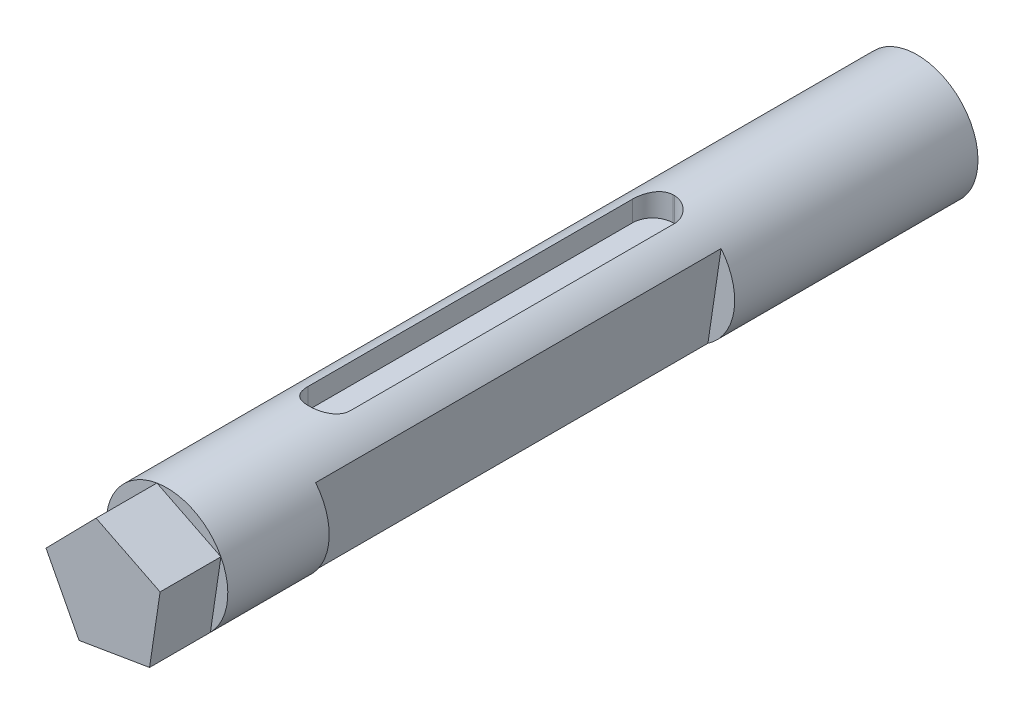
from build123d import *

# Parameters (mm, degrees)
SKETCH2_R               = 19.05
BOSS_EXTRUDE1_DEPTH     = 254
SKETCH3_W               = 64.146717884
SKETCH3_H               = 53.485583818
CUT_EXTRUDE2_DEPTH      = 19.05
CUT_EXTRUDE3_DEPTH      = 7.62
CUT_EXTRUDE4_DEPTH      = 7.62
CUT_EXTRUDE4_DEPTH_BACK = 2.54
SKETCH6_W               = 127
SKETCH6_H               = 57.682293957


with BuildPart() as part:
    # Sketch2 → Boss-Extrude1 (new body)
    with BuildSketch(Plane.XY):
        Circle(SKETCH2_R)
    extrude(amount=BOSS_EXTRUDE1_DEPTH)

    # Sketch3 → Cut-Extrude2 (cut)
    with BuildSketch(Plane.XY.offset(254)):
        Rectangle(SKETCH3_W, SKETCH3_H)
        Polygon((13.595541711, -13.344052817), (16.892201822, 8.806589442), (-3.15558684, 18.786824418), (-18.842461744, 2.804306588), (-8.489694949, -17.053667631), align=None, mode=Mode.SUBTRACT)
    extrude(amount=-CUT_EXTRUDE2_DEPTH, mode=Mode.SUBTRACT)

    # Sketch4 → Cut-Extrude3 (cut)
    with BuildSketch(Plane(origin=(0, 19.05, 0), x_dir=(1, 0, 0), z_dir=(0, 1, 0))):
        with BuildLine():
            Line((0.248750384, -76.2), (-0.259249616, -76.2))
            ThreePointArc((-0.259249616, -76.2), (-4.749377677, -78.059871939), (-6.609249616, -82.55))
            Line((-6.609249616, -82.55), (-6.609249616, -184.15))
            ThreePointArc((-6.609249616, -184.15), (-4.749377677, -188.640128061), (-0.259249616, -190.5))
            Line((-0.259249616, -190.5), (0.248750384, -190.5))
            ThreePointArc((0.248750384, -190.5), (4.738878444, -188.640128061), (6.598750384, -184.15))
            Line((6.598750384, -184.15), (6.598750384, -82.55))
            ThreePointArc((6.598750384, -82.55), (4.738878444, -78.059871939), (0.248750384, -76.2))
        make_face()
    extrude(amount=-CUT_EXTRUDE3_DEPTH, mode=Mode.SUBTRACT)

    # Sketch6 → Cut-Extrude4 (cut, two sides: drawn at the far end of the back side and taken through both)
    with BuildSketch(Plane(origin=(15.243871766, -2.268731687, 0), x_dir=(0, 0, -1), z_dir=(0.9891056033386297, -0.14720769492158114, 0)).offset(-CUT_EXTRUDE4_DEPTH_BACK)):
        with Locations((-139.7, 1.952106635)):
            Rectangle(SKETCH6_W, SKETCH6_H)
    extrude(amount=CUT_EXTRUDE4_DEPTH + CUT_EXTRUDE4_DEPTH_BACK, mode=Mode.SUBTRACT)


solid = part.part
